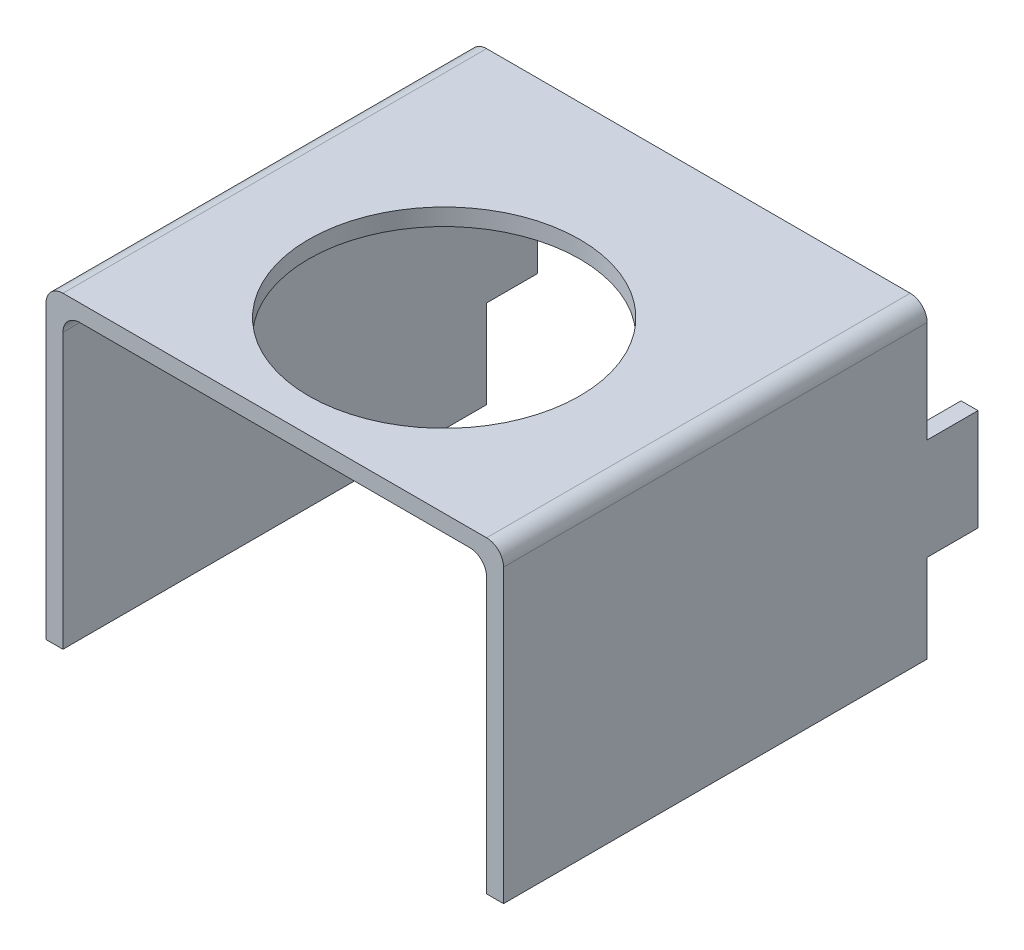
from build123d import *

# Parameters (mm, degrees)
SKETCH_1_W          = 135
SKETCH_1_H          = 91
EXTRUDE_1_DEPTH     = 125
SHELL_1_T           = -5
FILLET_1_R          = 5
SKETCH_4_R          = 40
CUT_EXTRUDE_1_DEPTH = 35
SKETCH_5_W          = 5
SKETCH_5_H          = 30
EXTRUDE_5_DEPTH     = 15


with BuildPart() as part:
    # Sketch 1 → Extrude 1 (new body)
    with BuildSketch(Plane.XY):
        Rectangle(SKETCH_1_W, SKETCH_1_H)
    extrude(amount=EXTRUDE_1_DEPTH)

    # Shell 1
    shell_1_openings = [part.faces().sort_by_distance(p)[0] for p in [
        (0, 0, 125),
        (0, 0, 0),
        (0, -45.5, 62.5),
    ]]
    offset(amount=SHELL_1_T, openings=shell_1_openings, kind=Kind.INTERSECTION)

    # Fillet 1
    fillet_1_edges = [part.edges().sort_by_distance(p)[0] for p in [
        (-62.5, 40.5, 62.5),
        (62.5, 40.5, 62.5),
        (-67.5, 45.5, 62.5),
        (67.5, 45.5, 62.5),
    ]]
    fillet(fillet_1_edges, radius=FILLET_1_R)

    # Sketch 4 → Cut-Extrude 1 (cut)
    with BuildSketch(Plane(origin=(0, 45.5, 0), x_dir=(1, 0, 0), z_dir=(0, 1, 0))):
        with Locations(Location((0, -75, 0), (0, 0, 180))):
            Circle(SKETCH_4_R)
    extrude(amount=-CUT_EXTRUDE_1_DEPTH, mode=Mode.SUBTRACT)

    # Sketch 5 → Extrude 5 (add)
    with BuildSketch(Plane(origin=(0, 0, 0), x_dir=(-1, 0, 0), z_dir=(0, 0, -1))):
        with Locations((65, -4.5)):
            Rectangle(SKETCH_5_W, SKETCH_5_H)
        with Locations((-65, -4.5)):
            Rectangle(SKETCH_5_W, SKETCH_5_H)
    extrude(amount=EXTRUDE_5_DEPTH)


solid = part.part
